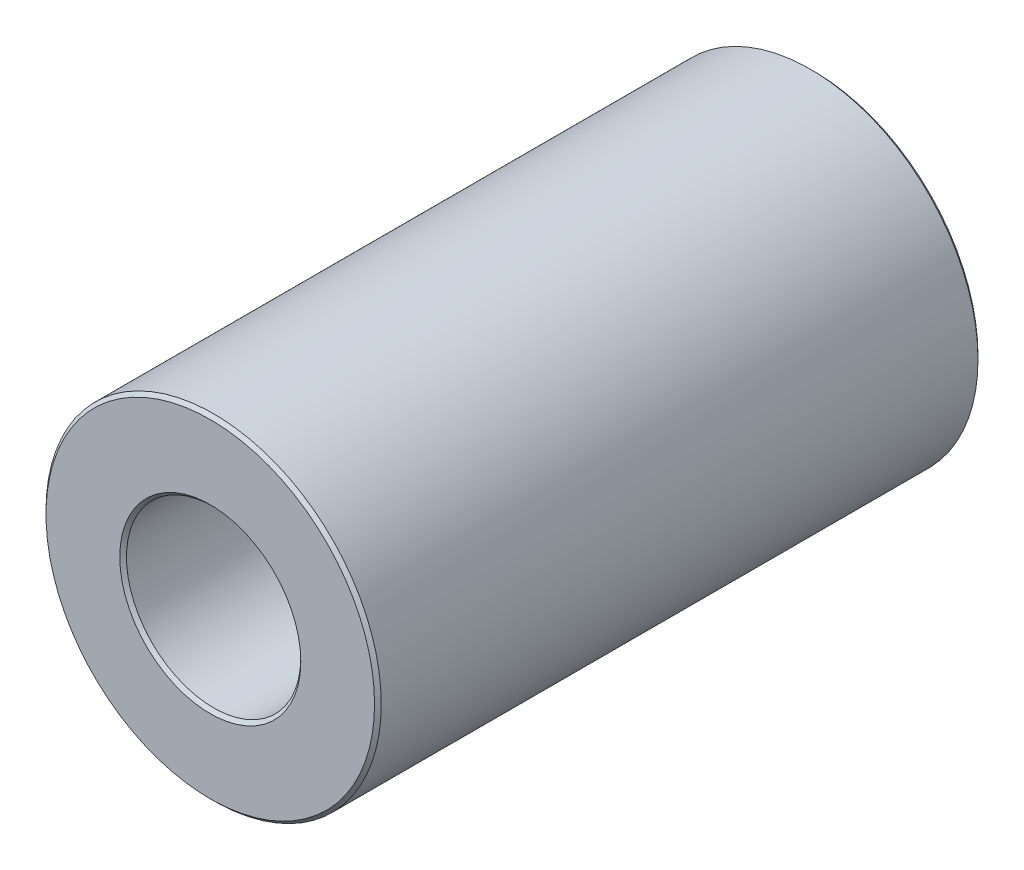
from build123d import *

# Parameters (mm, degrees)
SKETCH1_R           = 5
SKETCH1_R_2         = 2.6
BOSS_EXTRUDE2_DEPTH = 9
CHAMFER3_SIZE       = 0.1


with BuildPart() as part:
    # Sketch1 → Boss-Extrude2 (new, symmetric)
    with BuildSketch(Plane.XY):
        Circle(SKETCH1_R)
        Circle(SKETCH1_R_2, mode=Mode.SUBTRACT)
    extrude(amount=BOSS_EXTRUDE2_DEPTH, both=True)

    # Chamfer3
    chamfer3_edges = [part.edges().sort_by_distance(p)[0] for p in [
        (-5, 0, -9),
        (-5, 0, 9),
        (-2.6, 0, -9),
        (-2.6, 0, 9),
    ]]
    chamfer(chamfer3_edges, length=CHAMFER3_SIZE)


solid = part.part
